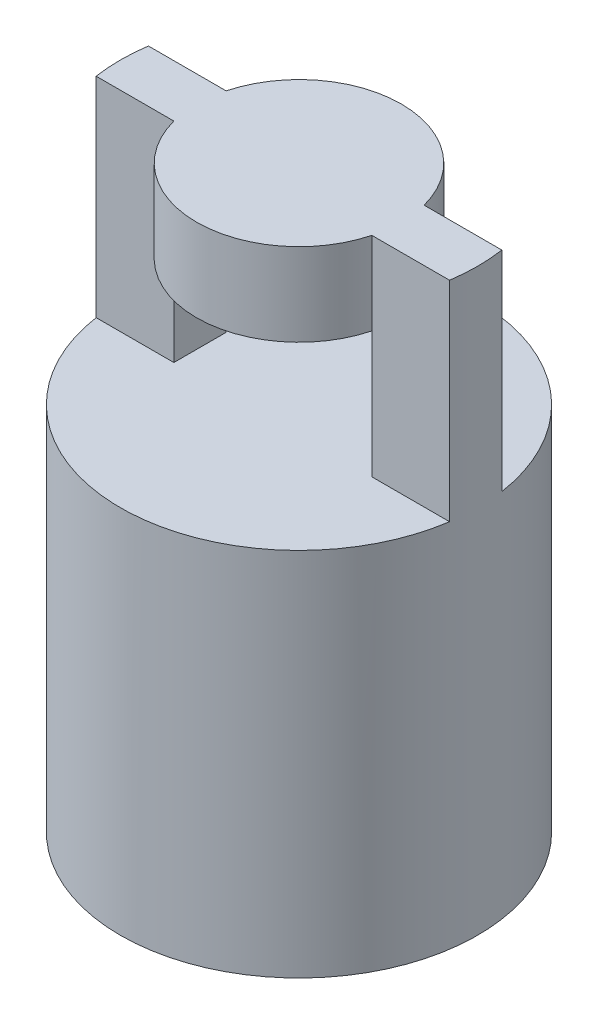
from build123d import *

# Parameters (mm, degrees)
ESQUISSE1_R             = 4.1
BOSS_EXTRU_1_DEPTH      = 13.3
ENL_V_START             = -4.8
ENL_V_MAT_EXTRU_1_DEPTH = 4.8
ESQUISSE3_W             = 4.544227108
ESQUISSE3_H             = 2.9
ENL_V_MAT_EXTRU_2_DEPTH = 5
ESQUISSE4_R             = 1.5
ENL_V_MAT_EXTRU_3_DEPTH = 8


with BuildPart() as part:
    # Esquisse1 → Boss.-Extru.1 (new body)
    with BuildSketch(Plane(origin=(0, 0, 0), x_dir=(1, 0, 0), z_dir=(0, 1, 0))):
        with Locations(Location((0, 0, 0), (0, 0, 270))):
            Circle(ESQUISSE1_R)
    extrude(amount=BOSS_EXTRU_1_DEPTH)

    # Esquisse2 → Enl_v. mat.-Extru.1 (cut)
    with BuildSketch(Plane(origin=(0, 13.3, 0), x_dir=(1, 0, 0), z_dir=(0, 1, 0)).offset(ENL_V_START)):
        with BuildLine():
            Line((-4.055859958, 0.6), (-2.272113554, 0.6))
            ThreePointArc((-2.272113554, 0.6), (0, 2.35), (2.272113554, 0.6))
            Line((2.272113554, 0.6), (4.055859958, 0.6))
            ThreePointArc((4.055859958, 0.6), (0, 4.1), (-4.055859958, 0.6))
        make_face()
        with BuildLine():
            Line((2.272113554, -0.6), (4.055859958, -0.6))
            ThreePointArc((4.055859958, -0.6), (0, -4.1), (-4.055859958, -0.6))
            Line((-4.055859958, -0.6), (-2.272113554, -0.6))
            ThreePointArc((-2.272113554, -0.6), (0, -2.35), (2.272113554, -0.6))
        make_face()
    extrude(amount=ENL_V_MAT_EXTRU_1_DEPTH, mode=Mode.SUBTRACT)

    # Esquisse3 → Enl_v. mat.-Extru.2 (cut, symmetric)
    with BuildSketch(Plane.XY):
        with Locations((0, 9.95)):
            Rectangle(ESQUISSE3_W, ESQUISSE3_H)
    extrude(amount=ENL_V_MAT_EXTRU_2_DEPTH, both=True, mode=Mode.SUBTRACT)

    # Esquisse4 → Enl_v. mat.-Extru.3 (cut)
    with BuildSketch(Plane.XZ):
        with Locations(Location((0, 0, 0), (0, 0, 270))):
            Circle(ESQUISSE4_R)
    extrude(amount=-ENL_V_MAT_EXTRU_3_DEPTH, mode=Mode.SUBTRACT)


solid = part.part
